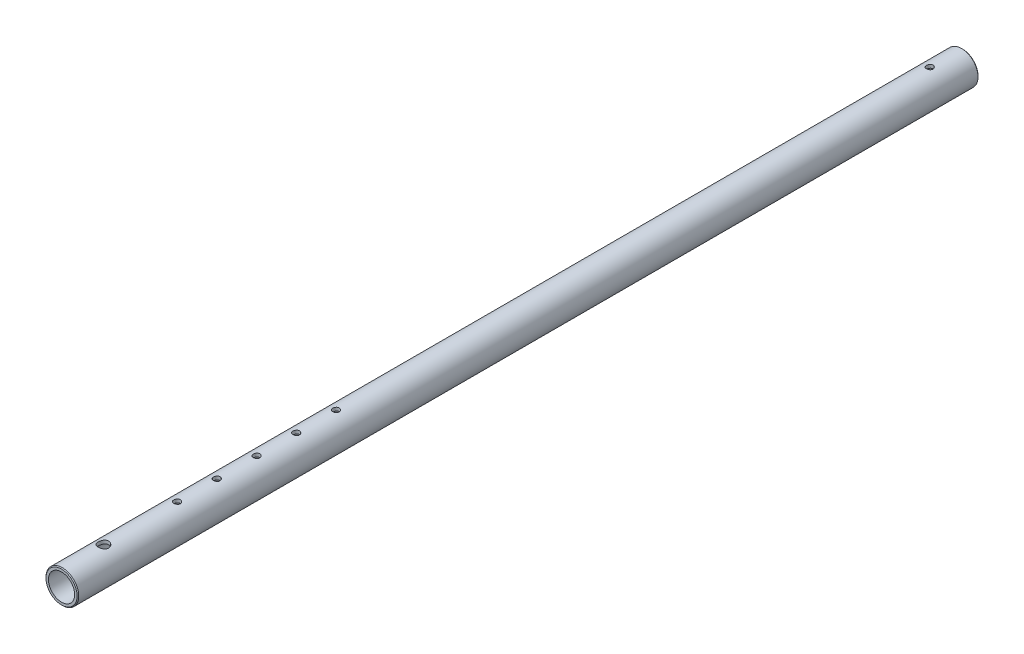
from build123d import *

# Parameters (mm, degrees)
ESQUISSE1_R                  = 10
ESQUISSE1_R_2                = 8
BASE_EXTRU_MINCE_DEPTH       = 550
CHANFREIN1_SIZE              = 0.5
ENL_V_MAT_EXTRU_4_DEPTH      = 11
ENL_V_MAT_EXTRU_4_DEPTH_BACK = 11
ESQUISSE2_R                  = 2
ESQUISSE2_R_2                = 3.25


with BuildPart() as part:
    # Esquisse1 → Base-Extru.-Mince (new body)
    with BuildSketch(Plane.XY):
        Circle(ESQUISSE1_R)
        Circle(ESQUISSE1_R_2, mode=Mode.SUBTRACT)
    extrude(amount=BASE_EXTRU_MINCE_DEPTH)

    # Chanfrein1
    chanfrein1_edges = [part.edges().sort_by_distance(p)[0] for p in [
        (-10, 0, 0),
        (-10, 0, 550),
    ]]
    chamfer(chanfrein1_edges, length=CHANFREIN1_SIZE)

    # Esquisse2 → Enl_v. mat.-Extru.4 (cut, two sides: drawn at the far end of the back side and taken through both)
    with BuildSketch(Plane(origin=(0, 0, 0), x_dir=(1, 0, 0), z_dir=(0, 1, 0)).offset(-ENL_V_MAT_EXTRU_4_DEPTH_BACK)):
        with Locations(Location((0, -20, 0), (0, 0, 270))):
            Circle(ESQUISSE2_R)
        with Locations(Location((0, -479.5, 0), (0, 0, 270))):
            Circle(ESQUISSE2_R)
        with Locations(Location((0, -455.25, 0), (0, 0, 270))):
            Circle(ESQUISSE2_R)
        with Locations(Location((0, -431, 0), (0, 0, 270))):
            Circle(ESQUISSE2_R)
        with Locations(Location((0, -406.75, 0), (0, 0, 270))):
            Circle(ESQUISSE2_R)
        with Locations(Location((0, -382.5, 0), (0, 0, 270))):
            Circle(ESQUISSE2_R)
        with Locations(Location((0, -524.5, 0), (0, 0, 270))):
            Circle(ESQUISSE2_R_2)
    extrude(amount=ENL_V_MAT_EXTRU_4_DEPTH + ENL_V_MAT_EXTRU_4_DEPTH_BACK, mode=Mode.SUBTRACT)


solid = part.part
